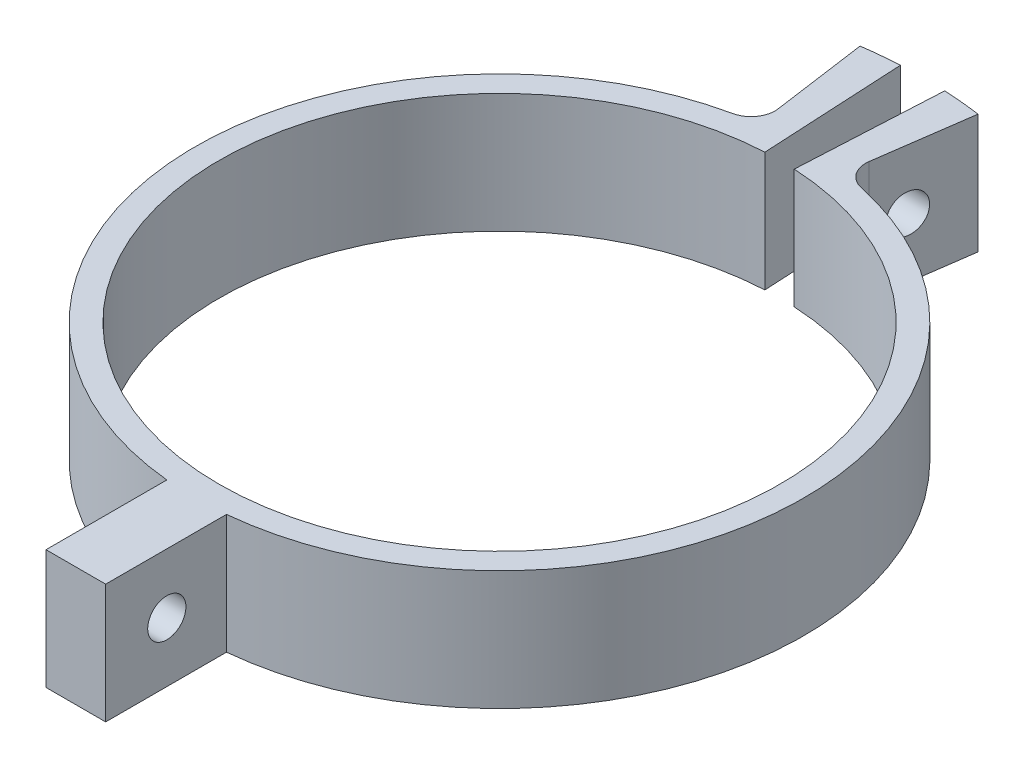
from build123d import *

# Parameters (mm, degrees)
SKETCH1_R                    = 32.385
SKETCH1_R_2                  = 29.845
BOSS_EXTRUDE1_DEPTH          = 12.7
SKETCH2_W                    = 12.7
SKETCH2_H                    = 12.7
REVOLVE1_ANGLE               = 8
REVOLVE1_OTHER_WAY_ANGLE     = 8
SKETCH3_W                    = 45.085
SKETCH3_H                    = 12.7
CUT_REVOLVE1_ANGLE           = 3
CUT_REVOLVE1_OTHER_WAY_ANGLE = 3
CUT_EXTRUDE1_DEPTH           = 12.7
CUT_EXTRUDE1_DEPTH_BACK      = 12.7
SKETCH4_R                    = 2.032
BOSS_EXTRUDE2_DEPTH          = 3.175
BOSS_EXTRUDE2_DEPTH_BACK     = 3.175
SKETCH5_W                    = 15.24
SKETCH5_H                    = 12.7
SKETCH6_R                    = 2.032
CUT_EXTRUDE3_DEPTH           = 59.808679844
FILLET1_R                    = 2.54
FILLET2_R                    = 2.54


with BuildPart() as part:
    # Sketch1 → Boss-Extrude1 (new body)
    with BuildSketch(Plane(origin=(0, 0, 0), x_dir=(1, 0, 0), z_dir=(0, 1, 0))):
        with Locations(Location((0, 0, 0), (0, 0, 270))):
            Circle(SKETCH1_R)
        with Locations(Location((0, 0, 0), (0, 0, 270))):
            Circle(SKETCH1_R_2, mode=Mode.SUBTRACT)
    extrude(amount=BOSS_EXTRUDE1_DEPTH)

    # Sketch2 → Revolve1 (revolve)
    with BuildSketch(Plane(origin=(0, 0, 0), x_dir=(0, 0, -1), z_dir=(1, 0, 0))):
        with Locations((38.735, 6.35)):
            Rectangle(SKETCH2_W, SKETCH2_H)
    revolve(axis=Axis((0, 12.7, 0), (0, -1, 0)), revolution_arc=REVOLVE1_ANGLE)

    # Sketch2 → Revolve1 other way (revolve)
    with BuildSketch(Plane(origin=(0, 0, 0), x_dir=(0, 0, -1), z_dir=(1, 0, 0))):
        with Locations((38.735, 6.35)):
            Rectangle(SKETCH2_W, SKETCH2_H)
    revolve(axis=Axis((0, 12.7, 0), (0, 1, 0)), revolution_arc=REVOLVE1_OTHER_WAY_ANGLE)

    # Sketch3 → Cut-Revolve1 (revolve, cut)
    with BuildSketch(Plane(origin=(0, 0, 0), x_dir=(0, 0, -1), z_dir=(1, 0, 0))):
        with Locations((22.5425, 6.35)):
            Rectangle(SKETCH3_W, SKETCH3_H)
    revolve(axis=Axis((0, 0, 0), (0, 1, 0)), revolution_arc=CUT_REVOLVE1_ANGLE, mode=Mode.SUBTRACT)

    # Sketch3 → Cut-Revolve1 other way (revolve, cut)
    with BuildSketch(Plane(origin=(0, 0, 0), x_dir=(0, 0, -1), z_dir=(1, 0, 0))):
        with Locations((22.5425, 6.35)):
            Rectangle(SKETCH3_W, SKETCH3_H)
    revolve(axis=Axis((0, 0, 0), (0, -1, 0)), revolution_arc=CUT_REVOLVE1_OTHER_WAY_ANGLE, mode=Mode.SUBTRACT)

    # Sketch4 → Cut-Extrude1 (cut, two sides: drawn at the far end of the back side and taken through both)
    with BuildSketch(Plane(origin=(0, 0, 0), x_dir=(0, 0, -1), z_dir=(1, 0, 0)).offset(-CUT_EXTRUDE1_DEPTH_BACK)):
        with Locations((38.1, 6.35)):
            Circle(SKETCH4_R)
    extrude(amount=CUT_EXTRUDE1_DEPTH + CUT_EXTRUDE1_DEPTH_BACK, mode=Mode.SUBTRACT)

    # Sketch5 → Boss-Extrude2 (add, two sides: drawn at the far end of the back side and taken through both)
    with BuildSketch(Plane(origin=(0, 0, 0), x_dir=(0, 0, -1), z_dir=(1, 0, 0)).offset(-BOSS_EXTRUDE2_DEPTH_BACK)):
        with Locations((-37.465, 6.35)):
            Rectangle(SKETCH5_W, SKETCH5_H)
    extrude(amount=BOSS_EXTRUDE2_DEPTH + BOSS_EXTRUDE2_DEPTH_BACK)

    # Sketch6 → Cut-Extrude3 (cut, through all)
    with BuildSketch(Plane(origin=(3.175, 0, 0), x_dir=(0, 0, -1), z_dir=(1, 0, 0))):
        with Locations((-38.578986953, 6.350479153)):
            Circle(SKETCH6_R)
    extrude(amount=-CUT_EXTRUDE3_DEPTH, mode=Mode.SUBTRACT)

    # Fillet1
    fillet1_edges = [part.edges().sort_by_distance(p)[0] for p in [
        (4.507120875, 6.35, -32.069831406),
    ]]
    fillet(fillet1_edges, radius=FILLET1_R)

    # Fillet2
    fillet2_edges = [part.edges().sort_by_distance(p)[0] for p in [
        (-4.507120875, 6.35, -32.069831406),
    ]]
    fillet(fillet2_edges, radius=FILLET2_R)


solid = part.part
